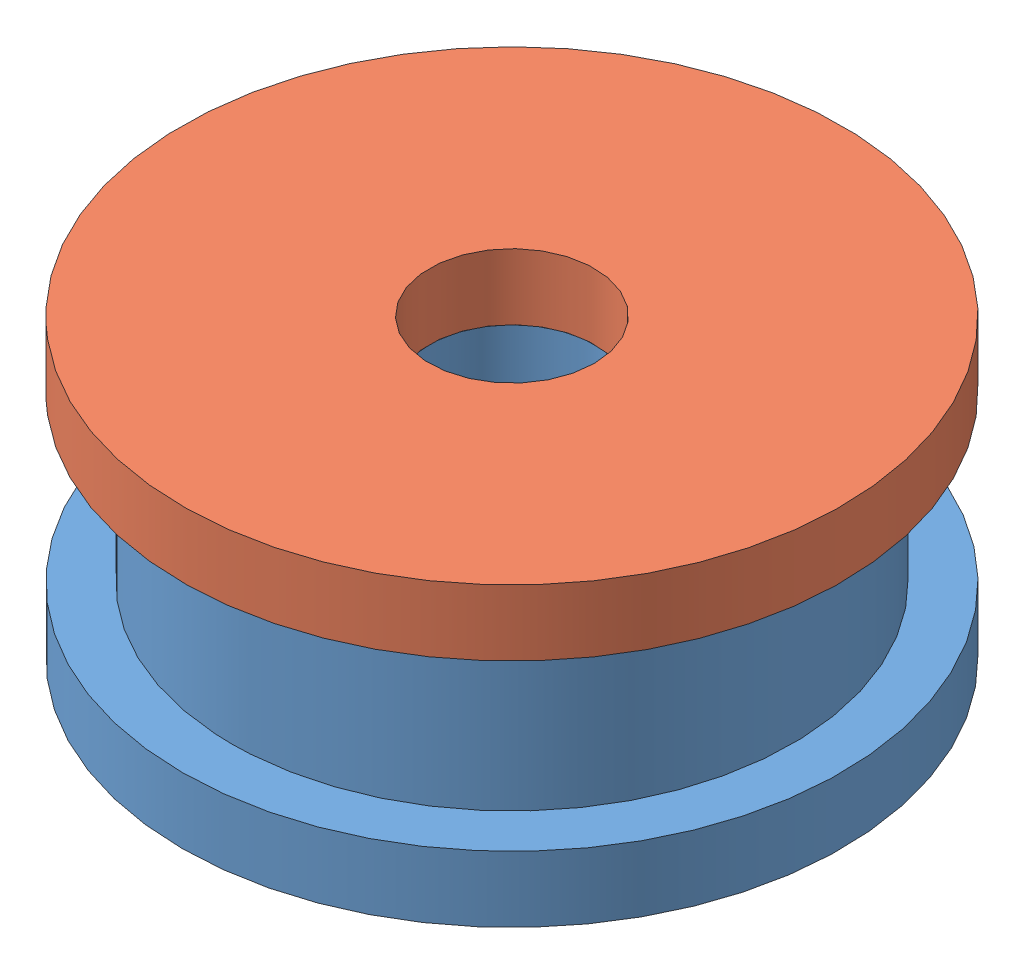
SolidWorks assembly 装配体1.sldasm, configuration 默认 (file format 6000). Lengths in mm.
Overall size (28.27 9 28.27).
2 component instances, 2 part files, 3 mates.
Components (placement in the parent):
- rad-halb-1-1: rad-halb-1.SLDPRT [默认] at origin size (20 7 20)
- rad-halb-2-1: rad-halb-2.SLDPRT [默认] at (0 7 0) x (-0.726706 0 -0.686948) z (-0.686948 0 0.726706) size (20 4.9 20)
Mates (geometry in assembly coordinates):
- 同心1: concentric: cylinder of rad-halb-1-1 through (0 -2 0) axis (0 1 0) radius 2.5; cylinder of rad-halb-2-1 through (0 13.1074 0) axis (0 -1 0) radius 2.5
- 同心2: concentric: cylinder of rad-halb-1-1 through (0 2 0) axis (0 1 0) radius 4.5; cylinder of rad-halb-2-1 through (0 2.1 0) axis (0 1 0) radius 6.45
- 重合1: coincident anti-aligned: plane of rad-halb-1-1 through (0 5 0) normal (0 1 0); plane of rad-halb-2-1 through (0 5 0) normal (0 -1 0)
